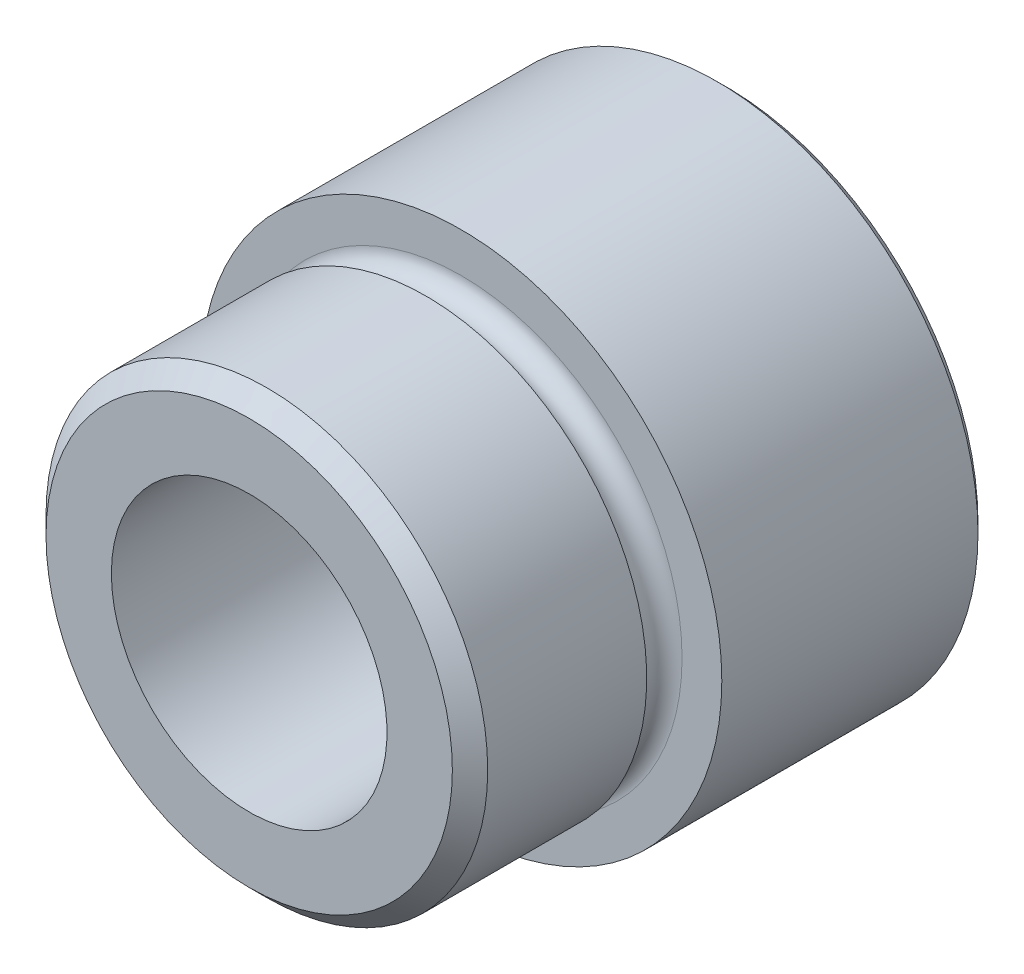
ISO-10303-21;
HEADER;
FILE_DESCRIPTION(('STEP AP214'),'2;1');
FILE_NAME('part.step','',(''),(''),'','','');
FILE_SCHEMA(('AUTOMOTIVE_DESIGN { 1 0 10303 214 1 1 1 1 }'));
ENDSEC;
DATA;
#1=APPLICATION_CONTEXT('core data for automotive mechanical design processes');
#2=APPLICATION_PROTOCOL_DEFINITION('international standard','automotive_design',2000,#1);
#3=PRODUCT_CONTEXT('',#1,'mechanical');
#4=PRODUCT('Part','Part','',(#3));
#5=PRODUCT_RELATED_PRODUCT_CATEGORY('part','',(#4));
#6=PRODUCT_DEFINITION_FORMATION('','',#4);
#7=PRODUCT_DEFINITION_CONTEXT('part definition',#1,'design');
#8=PRODUCT_DEFINITION('design','',#6,#7);
#9=PRODUCT_DEFINITION_SHAPE('','',#8);
#10=(LENGTH_UNIT() NAMED_UNIT(*) SI_UNIT(.MILLI.,.METRE.));
#11=(NAMED_UNIT(*) PLANE_ANGLE_UNIT() SI_UNIT($,.RADIAN.));
#12=(NAMED_UNIT(*) SI_UNIT($,.STERADIAN.) SOLID_ANGLE_UNIT());
#13=UNCERTAINTY_MEASURE_WITH_UNIT(LENGTH_MEASURE(1.E-05),#10,'distance_accuracy_value','');
#14=(GEOMETRIC_REPRESENTATION_CONTEXT(3) GLOBAL_UNCERTAINTY_ASSIGNED_CONTEXT((#13)) GLOBAL_UNIT_ASSIGNED_CONTEXT((#10,
#11,#12)) REPRESENTATION_CONTEXT('',''));
#15=CARTESIAN_POINT('',(0.,0.,0.));
#16=DIRECTION('',(0.,0.,1.));
#17=DIRECTION('',(1.,0.,0.));
#18=AXIS2_PLACEMENT_3D('',#15,#16,#17);
#19=CARTESIAN_POINT('',(0.,0.,15.));
#20=DIRECTION('',(0.,0.,1.));
#21=DIRECTION('',(1.00000000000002,0.,0.));
#22=AXIS2_PLACEMENT_3D('',#19,#20,#21);
#23=PLANE('',#22);
#24=CARTESIAN_POINT('',(0.,0.,15.));
#25=DIRECTION('',(0.,0.,1.));
#26=DIRECTION('',(1.00000000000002,0.,0.));
#27=AXIS2_PLACEMENT_3D('',#24,#25,#26);
#28=CIRCLE('',#27,14.75);
#29=CARTESIAN_POINT('',(14.7500000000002,0.,15.));
#30=VERTEX_POINT('',#29);
#31=EDGE_CURVE('E44',#30,#30,#28,.T.);
#32=ORIENTED_EDGE('',*,*,#31,.T.);
#33=EDGE_LOOP('',(#32));
#34=FACE_BOUND('',#33,.T.);
#35=CARTESIAN_POINT('',(0.,0.,15.));
#36=DIRECTION('',(0.,0.,1.));
#37=DIRECTION('',(1.00000000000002,0.,0.));
#38=AXIS2_PLACEMENT_3D('',#35,#36,#37);
#39=CIRCLE('',#38,12.5);
#40=CARTESIAN_POINT('',(12.5000000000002,0.,15.));
#41=VERTEX_POINT('',#40);
#42=EDGE_CURVE('E48',#41,#41,#39,.F.);
#43=ORIENTED_EDGE('',*,*,#42,.T.);
#44=EDGE_LOOP('',(#43));
#45=FACE_BOUND('',#44,.T.);
#46=ADVANCED_FACE('F24',(#34,#45),#23,.T.);
#47=CARTESIAN_POINT('',(0.,0.,15.));
#48=DIRECTION('',(0.,0.,-1.));
#49=DIRECTION('',(-1.00000000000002,0.,0.));
#50=AXIS2_PLACEMENT_3D('',#47,#48,#49);
#51=CYLINDRICAL_SURFACE('',#50,14.75);
#52=CARTESIAN_POINT('',(0.,0.,0.5));
#53=DIRECTION('',(0.,0.,1.));
#54=DIRECTION('',(1.00000000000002,0.,0.));
#55=AXIS2_PLACEMENT_3D('',#52,#53,#54);
#56=CIRCLE('',#55,14.75);
#57=CARTESIAN_POINT('',(14.7500000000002,0.,0.500000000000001));
#58=VERTEX_POINT('',#57);
#59=EDGE_CURVE('E31',#58,#58,#56,.T.);
#60=ORIENTED_EDGE('',*,*,#59,.T.);
#61=EDGE_LOOP('',(#60));
#62=FACE_BOUND('',#61,.T.);
#63=ORIENTED_EDGE('',*,*,#31,.F.);
#64=EDGE_LOOP('',(#63));
#65=FACE_BOUND('',#64,.T.);
#66=ADVANCED_FACE('F26',(#62,#65),#51,.T.);
#67=CARTESIAN_POINT('',(0.,0.,0.));
#68=DIRECTION('',(0.,0.,1.));
#69=DIRECTION('',(1.00000000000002,0.,0.));
#70=AXIS2_PLACEMENT_3D('',#67,#68,#69);
#71=PLANE('',#70);
#72=CARTESIAN_POINT('',(0.,0.,0.));
#73=DIRECTION('',(0.,0.,1.));
#74=DIRECTION('',(1.00000000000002,0.,0.));
#75=AXIS2_PLACEMENT_3D('',#72,#73,#74);
#76=CIRCLE('',#75,14.25);
#77=CARTESIAN_POINT('',(14.2500000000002,0.,0.));
#78=VERTEX_POINT('',#77);
#79=EDGE_CURVE('E10',#78,#78,#76,.F.);
#80=ORIENTED_EDGE('',*,*,#79,.T.);
#81=EDGE_LOOP('',(#80));
#82=FACE_BOUND('',#81,.T.);
#83=CARTESIAN_POINT('',(0.,0.,0.));
#84=DIRECTION('',(0.,0.,-1.));
#85=DIRECTION('',(-1.00000000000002,0.,0.));
#86=AXIS2_PLACEMENT_3D('',#83,#84,#85);
#87=CIRCLE('',#86,7.8);
#88=CARTESIAN_POINT('',(-7.80000000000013,0.,0.));
#89=VERTEX_POINT('',#88);
#90=EDGE_CURVE('E54',#89,#89,#87,.T.);
#91=ORIENTED_EDGE('',*,*,#90,.F.);
#92=EDGE_LOOP('',(#91));
#93=FACE_BOUND('',#92,.T.);
#94=ADVANCED_FACE('F85',(#82,#93),#71,.F.);
#95=CARTESIAN_POINT('',(0.,0.,27.));
#96=DIRECTION('',(0.,0.,-1.));
#97=DIRECTION('',(-1.00000000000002,0.,0.));
#98=AXIS2_PLACEMENT_3D('',#95,#96,#97);
#99=CYLINDRICAL_SURFACE('',#98,12.5);
#100=CARTESIAN_POINT('',(0.,0.,26.));
#101=DIRECTION('',(0.,0.,1.));
#102=DIRECTION('',(1.00000000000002,0.,0.));
#103=AXIS2_PLACEMENT_3D('',#100,#101,#102);
#104=CIRCLE('',#103,12.5);
#105=CARTESIAN_POINT('',(12.5000000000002,0.,26.));
#106=VERTEX_POINT('',#105);
#107=EDGE_CURVE('E35',#106,#106,#104,.F.);
#108=ORIENTED_EDGE('',*,*,#107,.T.);
#109=EDGE_LOOP('',(#108));
#110=FACE_BOUND('',#109,.T.);
#111=CARTESIAN_POINT('',(0.,0.,17.));
#112=DIRECTION('',(0.,0.,-1.));
#113=DIRECTION('',(-1.00000000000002,0.,0.));
#114=AXIS2_PLACEMENT_3D('',#111,#112,#113);
#115=CIRCLE('',#114,12.5);
#116=CARTESIAN_POINT('',(-12.5000000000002,0.,17.));
#117=VERTEX_POINT('',#116);
#118=EDGE_CURVE('E45',#117,#117,#115,.F.);
#119=ORIENTED_EDGE('',*,*,#118,.T.);
#120=EDGE_LOOP('',(#119));
#121=FACE_BOUND('',#120,.T.);
#122=ADVANCED_FACE('F88',(#110,#121),#99,.T.);
#123=CARTESIAN_POINT('',(0.,0.,27.));
#124=DIRECTION('',(0.,0.,1.));
#125=DIRECTION('',(1.00000000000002,0.,0.));
#126=AXIS2_PLACEMENT_3D('',#123,#124,#125);
#127=PLANE('',#126);
#128=CARTESIAN_POINT('',(0.,0.,27.));
#129=DIRECTION('',(0.,0.,1.));
#130=DIRECTION('',(1.00000000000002,0.,0.));
#131=AXIS2_PLACEMENT_3D('',#128,#129,#130);
#132=CIRCLE('',#131,11.5);
#133=CARTESIAN_POINT('',(11.5000000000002,0.,27.));
#134=VERTEX_POINT('',#133);
#135=EDGE_CURVE('E39',#134,#134,#132,.T.);
#136=ORIENTED_EDGE('',*,*,#135,.T.);
#137=EDGE_LOOP('',(#136));
#138=FACE_BOUND('',#137,.T.);
#139=CARTESIAN_POINT('',(0.,0.,27.));
#140=DIRECTION('',(0.,0.,-1.));
#141=DIRECTION('',(-1.00000000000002,0.,0.));
#142=AXIS2_PLACEMENT_3D('',#139,#140,#141);
#143=CIRCLE('',#142,7.8);
#144=CARTESIAN_POINT('',(-7.80000000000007,0.,27.));
#145=VERTEX_POINT('',#144);
#146=EDGE_CURVE('E51',#145,#145,#143,.T.);
#147=ORIENTED_EDGE('',*,*,#146,.T.);
#148=EDGE_LOOP('',(#147));
#149=FACE_BOUND('',#148,.T.);
#150=ADVANCED_FACE('F74',(#138,#149),#127,.T.);
#151=CARTESIAN_POINT('',(0.,0.,27.));
#152=DIRECTION('',(0.,0.,-1.));
#153=DIRECTION('',(-1.00000000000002,0.,0.));
#154=AXIS2_PLACEMENT_3D('',#151,#152,#153);
#155=CYLINDRICAL_SURFACE('',#154,7.8);
#156=ORIENTED_EDGE('',*,*,#146,.F.);
#157=EDGE_LOOP('',(#156));
#158=FACE_BOUND('',#157,.T.);
#159=ORIENTED_EDGE('',*,*,#90,.T.);
#160=EDGE_LOOP('',(#159));
#161=FACE_BOUND('',#160,.T.);
#162=ADVANCED_FACE('F64',(#158,#161),#155,.F.);
#163=CARTESIAN_POINT('',(0.,0.,16.));
#164=DIRECTION('',(0.,0.,-1.));
#165=DIRECTION('',(-1.00000000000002,0.,0.));
#166=AXIS2_PLACEMENT_3D('',#163,#164,#165);
#167=TOROIDAL_SURFACE('',#166,12.5,1.);
#168=ORIENTED_EDGE('',*,*,#118,.F.);
#169=EDGE_LOOP('',(#168));
#170=FACE_BOUND('',#169,.T.);
#171=ORIENTED_EDGE('',*,*,#42,.F.);
#172=EDGE_LOOP('',(#171));
#173=FACE_BOUND('',#172,.T.);
#174=ADVANCED_FACE('F61',(#170,#173),#167,.F.);
#175=CARTESIAN_POINT('',(0.,0.,27.));
#176=DIRECTION('',(0.,0.,-1.));
#177=DIRECTION('',(-1.00000000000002,0.,0.));
#178=AXIS2_PLACEMENT_3D('',#175,#176,#177);
#179=CONICAL_SURFACE('',#178,11.5,0.785398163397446);
#180=ORIENTED_EDGE('',*,*,#107,.F.);
#181=EDGE_LOOP('',(#180));
#182=FACE_BOUND('',#181,.T.);
#183=ORIENTED_EDGE('',*,*,#135,.F.);
#184=EDGE_LOOP('',(#183));
#185=FACE_BOUND('',#184,.T.);
#186=ADVANCED_FACE('F63',(#182,#185),#179,.T.);
#187=CARTESIAN_POINT('',(0.,0.,0.5));
#188=DIRECTION('',(0.,0.,1.));
#189=DIRECTION('',(1.00000000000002,0.,0.));
#190=AXIS2_PLACEMENT_3D('',#187,#188,#189);
#191=CONICAL_SURFACE('',#190,14.75,0.78539816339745);
#192=ORIENTED_EDGE('',*,*,#79,.F.);
#193=EDGE_LOOP('',(#192));
#194=FACE_BOUND('',#193,.T.);
#195=ORIENTED_EDGE('',*,*,#59,.F.);
#196=EDGE_LOOP('',(#195));
#197=FACE_BOUND('',#196,.T.);
#198=ADVANCED_FACE('F71',(#194,#197),#191,.T.);
#199=CLOSED_SHELL('',(#46,#66,#94,#122,#150,#162,#174,#186,#198));
#200=MANIFOLD_SOLID_BREP('B2',#199);
#201=ADVANCED_BREP_SHAPE_REPRESENTATION('',(#18,#200),#14);
#202=SHAPE_DEFINITION_REPRESENTATION(#9,#201);
ENDSEC;
END-ISO-10303-21;
